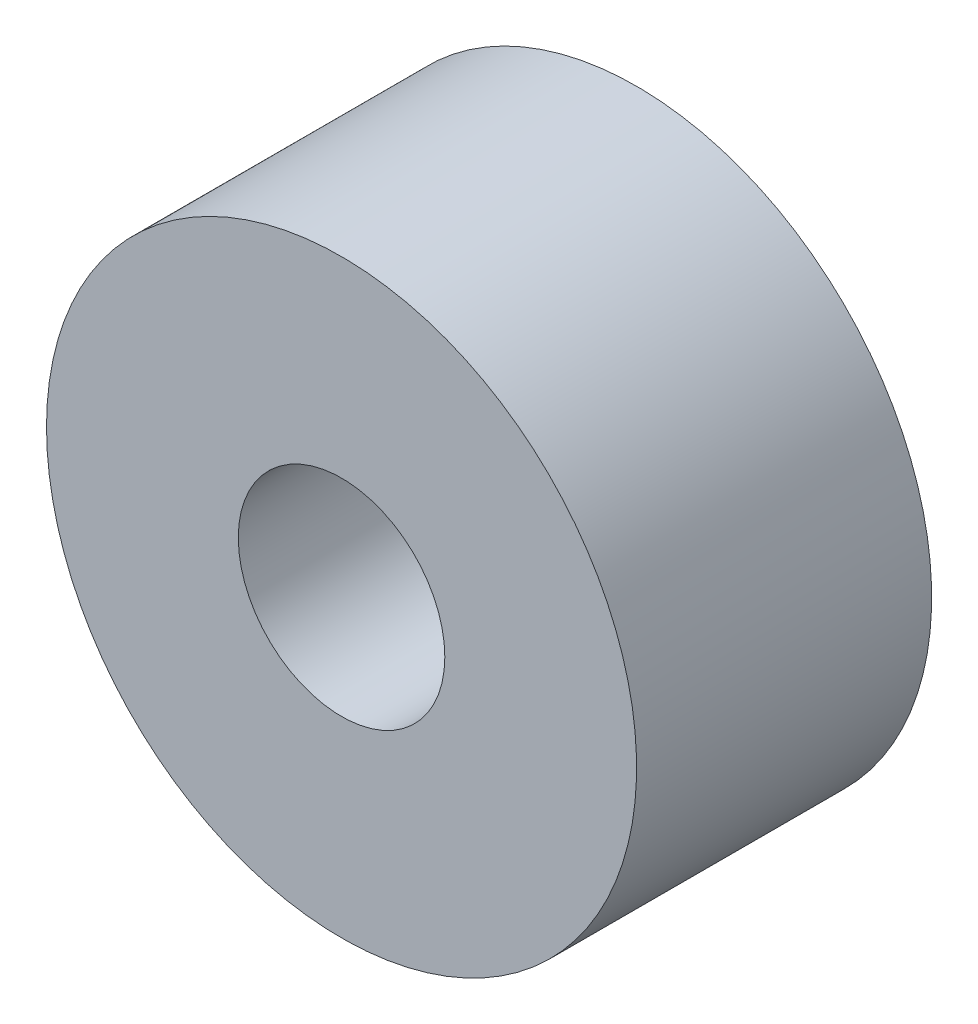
ISO-10303-21;
HEADER;
FILE_DESCRIPTION(('STEP AP214'),'2;1');
FILE_NAME('part.step','',(''),(''),'','','');
FILE_SCHEMA(('AUTOMOTIVE_DESIGN { 1 0 10303 214 1 1 1 1 }'));
ENDSEC;
DATA;
#1=APPLICATION_CONTEXT('core data for automotive mechanical design processes');
#2=APPLICATION_PROTOCOL_DEFINITION('international standard','automotive_design',2000,#1);
#3=PRODUCT_CONTEXT('',#1,'mechanical');
#4=PRODUCT('Part','Part','',(#3));
#5=PRODUCT_RELATED_PRODUCT_CATEGORY('part','',(#4));
#6=PRODUCT_DEFINITION_FORMATION('','',#4);
#7=PRODUCT_DEFINITION_CONTEXT('part definition',#1,'design');
#8=PRODUCT_DEFINITION('design','',#6,#7);
#9=PRODUCT_DEFINITION_SHAPE('','',#8);
#10=(LENGTH_UNIT() NAMED_UNIT(*) SI_UNIT(.MILLI.,.METRE.));
#11=(NAMED_UNIT(*) PLANE_ANGLE_UNIT() SI_UNIT($,.RADIAN.));
#12=(NAMED_UNIT(*) SI_UNIT($,.STERADIAN.) SOLID_ANGLE_UNIT());
#13=UNCERTAINTY_MEASURE_WITH_UNIT(LENGTH_MEASURE(1.E-05),#10,'distance_accuracy_value','');
#14=(GEOMETRIC_REPRESENTATION_CONTEXT(3) GLOBAL_UNCERTAINTY_ASSIGNED_CONTEXT((#13)) GLOBAL_UNIT_ASSIGNED_CONTEXT((#10,
#11,#12)) REPRESENTATION_CONTEXT('',''));
#15=CARTESIAN_POINT('',(0.,0.,0.));
#16=DIRECTION('',(0.,0.,1.));
#17=DIRECTION('',(1.,0.,0.));
#18=AXIS2_PLACEMENT_3D('',#15,#16,#17);
#19=CARTESIAN_POINT('',(0.,0.,0.));
#20=DIRECTION('',(0.,0.,-1.));
#21=DIRECTION('',(-1.,0.,0.));
#22=AXIS2_PLACEMENT_3D('',#19,#20,#21);
#23=PLANE('',#22);
#24=CARTESIAN_POINT('',(0.,0.,0.));
#25=DIRECTION('',(0.,0.,-1.));
#26=DIRECTION('',(-1.,0.,0.));
#27=AXIS2_PLACEMENT_3D('',#24,#25,#26);
#28=CIRCLE('',#27,5.25);
#29=CARTESIAN_POINT('',(-5.25,0.,0.));
#30=VERTEX_POINT('',#29);
#31=EDGE_CURVE('E43',#30,#30,#28,.T.);
#32=ORIENTED_EDGE('',*,*,#31,.T.);
#33=EDGE_LOOP('',(#32));
#34=FACE_BOUND('',#33,.T.);
#35=CARTESIAN_POINT('',(0.,0.,0.));
#36=DIRECTION('',(0.,0.,-1.));
#37=DIRECTION('',(-1.,0.,0.));
#38=AXIS2_PLACEMENT_3D('',#35,#36,#37);
#39=CIRCLE('',#38,15.);
#40=CARTESIAN_POINT('',(-15.,0.,0.));
#41=VERTEX_POINT('',#40);
#42=EDGE_CURVE('E10',#41,#41,#39,.T.);
#43=ORIENTED_EDGE('',*,*,#42,.F.);
#44=EDGE_LOOP('',(#43));
#45=FACE_BOUND('',#44,.T.);
#46=ADVANCED_FACE('F33',(#34,#45),#23,.F.);
#47=CARTESIAN_POINT('',(0.,0.,0.));
#48=DIRECTION('',(0.,0.,-1.));
#49=DIRECTION('',(-1.,0.,0.));
#50=AXIS2_PLACEMENT_3D('',#47,#48,#49);
#51=CYLINDRICAL_SURFACE('',#50,15.);
#52=CARTESIAN_POINT('',(0.,0.,-15.));
#53=DIRECTION('',(0.,0.,-1.));
#54=DIRECTION('',(-1.,0.,0.));
#55=AXIS2_PLACEMENT_3D('',#52,#53,#54);
#56=CIRCLE('',#55,15.);
#57=CARTESIAN_POINT('',(-15.,0.,-15.));
#58=VERTEX_POINT('',#57);
#59=EDGE_CURVE('E39',#58,#58,#56,.T.);
#60=ORIENTED_EDGE('',*,*,#59,.F.);
#61=EDGE_LOOP('',(#60));
#62=FACE_BOUND('',#61,.T.);
#63=ORIENTED_EDGE('',*,*,#42,.T.);
#64=EDGE_LOOP('',(#63));
#65=FACE_BOUND('',#64,.T.);
#66=ADVANCED_FACE('F58',(#62,#65),#51,.T.);
#67=CARTESIAN_POINT('',(0.,0.,-15.));
#68=DIRECTION('',(0.,0.,1.));
#69=DIRECTION('',(1.,0.,0.));
#70=AXIS2_PLACEMENT_3D('',#67,#68,#69);
#71=PLANE('',#70);
#72=CARTESIAN_POINT('',(0.,0.,-15.));
#73=DIRECTION('',(0.,0.,-1.));
#74=DIRECTION('',(-1.,0.,0.));
#75=AXIS2_PLACEMENT_3D('',#72,#73,#74);
#76=CIRCLE('',#75,5.25);
#77=CARTESIAN_POINT('',(-5.25,0.,-15.));
#78=VERTEX_POINT('',#77);
#79=EDGE_CURVE('E47',#78,#78,#76,.T.);
#80=ORIENTED_EDGE('',*,*,#79,.F.);
#81=EDGE_LOOP('',(#80));
#82=FACE_BOUND('',#81,.T.);
#83=ORIENTED_EDGE('',*,*,#59,.T.);
#84=EDGE_LOOP('',(#83));
#85=FACE_BOUND('',#84,.T.);
#86=ADVANCED_FACE('F56',(#82,#85),#71,.F.);
#87=CARTESIAN_POINT('',(0.,0.,0.));
#88=DIRECTION('',(0.,0.,-1.));
#89=DIRECTION('',(-1.,0.,0.));
#90=AXIS2_PLACEMENT_3D('',#87,#88,#89);
#91=CYLINDRICAL_SURFACE('',#90,5.25);
#92=ORIENTED_EDGE('',*,*,#79,.T.);
#93=EDGE_LOOP('',(#92));
#94=FACE_BOUND('',#93,.T.);
#95=ORIENTED_EDGE('',*,*,#31,.F.);
#96=EDGE_LOOP('',(#95));
#97=FACE_BOUND('',#96,.T.);
#98=ADVANCED_FACE('F53',(#94,#97),#91,.F.);
#99=CLOSED_SHELL('',(#46,#66,#86,#98));
#100=MANIFOLD_SOLID_BREP('B2',#99);
#101=ADVANCED_BREP_SHAPE_REPRESENTATION('',(#18,#100),#14);
#102=SHAPE_DEFINITION_REPRESENTATION(#9,#101);
ENDSEC;
END-ISO-10303-21;
